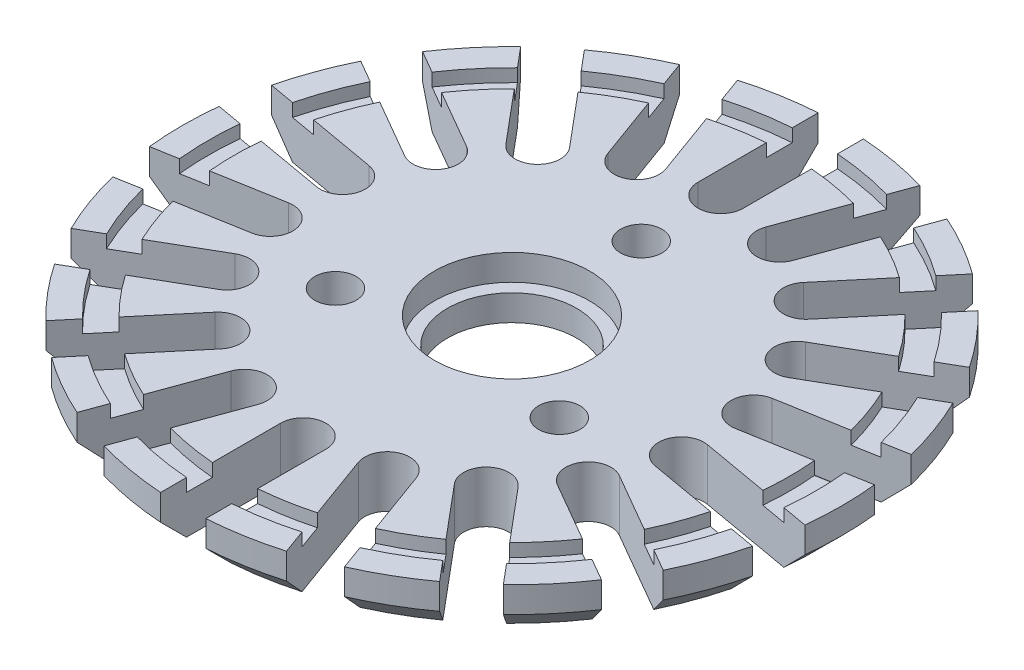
from build123d import *

# Parameters (mm, degrees)
ESBO_O1_R                = 5
RESSALTO_EXTRUS_O1_DEPTH = 4
ESBO_O2_R                = 6
CORTE_EXTRUS_O1_DEPTH    = 2
ESBO_O3_R                = 23.5
ESBO_O3_R_2              = 21.5
CORTE_EXTRUS_O2_DEPTH    = 1
CHANFRO1_SIZE            = 2
ESBO_O4_R                = 1.6
CORTE_EXTRUS_O3_DEPTH    = 37.241378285


with BuildPart() as part:
    # Esbo_o1 → Ressalto-extrus_o1 (new body)
    with BuildSketch(Plane(origin=(0, 0, 0), x_dir=(1, 0, 0), z_dir=(0, 1, 0))):
        with BuildLine():
            Line((1.75, 16.15), (1.75, 25.43988011))
            ThreePointArc((1.75, 25.43988011), (4.428028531, 25.112597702), (7.056489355, 24.504202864))
            Line((7.056489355, 24.504202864), (3.879163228, 15.774571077))
            ThreePointArc((3.879163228, 15.774571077), (4.925090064, 13.531573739), (7.168087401, 14.577500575))
            Line((7.168087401, 14.577500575), (10.345413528, 23.307132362))
            ThreePointArc((10.345413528, 23.307132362), (12.75, 22.083647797), (15.011861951, 20.612957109))
            Line((15.011861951, 20.612957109), (9.040442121, 13.496496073))
            ThreePointArc((9.040442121, 13.496496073), (9.256141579, 11.031039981), (11.721597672, 11.246739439))
            Line((11.721597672, 11.246739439), (17.693017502, 18.363200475))
            ThreePointArc((17.693017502, 18.363200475), (19.5341333, 16.391084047), (21.156582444, 14.235484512))
            Line((21.156582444, 14.235484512), (13.111310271, 9.590544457))
            ThreePointArc((13.111310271, 9.590544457), (12.470765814, 7.2), (14.861310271, 6.559455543))
            Line((14.861310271, 6.559455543), (22.906582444, 11.204395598))
            ThreePointArc((22.906582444, 11.204395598), (23.96216183, 8.721513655), (24.749506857, 6.141002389))
            Line((24.749506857, 6.141002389), (15.6007609, 4.527831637))
            ThreePointArc((15.6007609, 4.527831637), (14.181231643, 2.500533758), (16.208529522, 1.081004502))
            Line((16.208529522, 1.081004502), (25.357275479, 2.694175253))
            ThreePointArc((25.357275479, 2.694175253), (25.5, 0), (25.357275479, -2.694175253))
            Line((25.357275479, -2.694175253), (16.208529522, -1.081004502))
            ThreePointArc((16.208529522, -1.081004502), (14.181231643, -2.500533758), (15.6007609, -4.527831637))
            Line((15.6007609, -4.527831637), (24.749506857, -6.141002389))
            ThreePointArc((24.749506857, -6.141002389), (23.96216183, -8.721513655), (22.906582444, -11.204395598))
            Line((22.906582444, -11.204395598), (14.861310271, -6.559455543))
            ThreePointArc((14.861310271, -6.559455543), (12.470765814, -7.2), (13.111310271, -9.590544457))
            Line((13.111310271, -9.590544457), (21.156582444, -14.235484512))
            ThreePointArc((21.156582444, -14.235484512), (19.5341333, -16.391084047), (17.693017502, -18.363200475))
            Line((17.693017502, -18.363200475), (11.721597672, -11.246739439))
            ThreePointArc((11.721597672, -11.246739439), (9.256141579, -11.031039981), (9.040442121, -13.496496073))
            Line((9.040442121, -13.496496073), (15.011861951, -20.612957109))
            ThreePointArc((15.011861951, -20.612957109), (12.75, -22.083647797), (10.345413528, -23.307132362))
            Line((10.345413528, -23.307132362), (7.168087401, -14.577500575))
            ThreePointArc((7.168087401, -14.577500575), (4.925090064, -13.531573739), (3.879163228, -15.774571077))
            Line((3.879163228, -15.774571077), (7.056489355, -24.504202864))
            ThreePointArc((7.056489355, -24.504202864), (4.428028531, -25.112597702), (1.75, -25.43988011))
            Line((1.75, -25.43988011), (1.75, -16.15))
            ThreePointArc((1.75, -16.15), (0, -14.4), (-1.75, -16.15))
            Line((-1.75, -16.15), (-1.75, -25.43988011))
            ThreePointArc((-1.75, -25.43988011), (-4.428028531, -25.112597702), (-7.056489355, -24.504202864))
            Line((-7.056489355, -24.504202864), (-3.879163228, -15.774571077))
            ThreePointArc((-3.879163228, -15.774571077), (-4.925090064, -13.531573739), (-7.168087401, -14.577500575))
            Line((-7.168087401, -14.577500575), (-10.345413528, -23.307132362))
            ThreePointArc((-10.345413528, -23.307132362), (-12.75, -22.083647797), (-15.011861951, -20.612957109))
            Line((-15.011861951, -20.612957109), (-9.040442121, -13.496496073))
            ThreePointArc((-9.040442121, -13.496496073), (-9.256141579, -11.031039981), (-11.721597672, -11.246739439))
            Line((-11.721597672, -11.246739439), (-17.693017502, -18.363200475))
            ThreePointArc((-17.693017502, -18.363200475), (-19.5341333, -16.391084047), (-21.156582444, -14.235484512))
            Line((-21.156582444, -14.235484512), (-13.111310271, -9.590544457))
            ThreePointArc((-13.111310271, -9.590544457), (-12.470765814, -7.2), (-14.861310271, -6.559455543))
            Line((-14.861310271, -6.559455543), (-22.906582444, -11.204395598))
            ThreePointArc((-22.906582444, -11.204395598), (-23.96216183, -8.721513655), (-24.749506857, -6.141002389))
            Line((-24.749506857, -6.141002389), (-15.6007609, -4.527831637))
            ThreePointArc((-15.6007609, -4.527831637), (-14.181231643, -2.500533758), (-16.208529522, -1.081004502))
            Line((-16.208529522, -1.081004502), (-25.357275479, -2.694175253))
            ThreePointArc((-25.357275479, -2.694175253), (-25.5, 0), (-25.357275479, 2.694175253))
            Line((-25.357275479, 2.694175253), (-16.208529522, 1.081004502))
            ThreePointArc((-16.208529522, 1.081004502), (-14.181231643, 2.500533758), (-15.6007609, 4.527831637))
            Line((-15.6007609, 4.527831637), (-24.749506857, 6.141002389))
            ThreePointArc((-24.749506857, 6.141002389), (-23.96216183, 8.721513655), (-22.906582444, 11.204395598))
            Line((-22.906582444, 11.204395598), (-14.861310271, 6.559455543))
            ThreePointArc((-14.861310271, 6.559455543), (-12.470765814, 7.2), (-13.111310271, 9.590544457))
            Line((-13.111310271, 9.590544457), (-21.156582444, 14.235484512))
            ThreePointArc((-21.156582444, 14.235484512), (-19.5341333, 16.391084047), (-17.693017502, 18.363200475))
            Line((-17.693017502, 18.363200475), (-11.721597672, 11.246739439))
            ThreePointArc((-11.721597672, 11.246739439), (-9.256141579, 11.031039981), (-9.040442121, 13.496496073))
            Line((-9.040442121, 13.496496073), (-15.011861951, 20.612957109))
            ThreePointArc((-15.011861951, 20.612957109), (-12.75, 22.083647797), (-10.345413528, 23.307132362))
            Line((-10.345413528, 23.307132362), (-7.168087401, 14.577500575))
            ThreePointArc((-7.168087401, 14.577500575), (-4.925090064, 13.531573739), (-3.879163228, 15.774571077))
            Line((-3.879163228, 15.774571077), (-7.056489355, 24.504202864))
            ThreePointArc((-7.056489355, 24.504202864), (-4.428028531, 25.112597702), (-1.75, 25.43988011))
            Line((-1.75, 25.43988011), (-1.75, 16.15))
            ThreePointArc((-1.75, 16.15), (0, 14.4), (1.75, 16.15))
        make_face()
        with Locations(Location((0, 0, 0), (0, 0, 270))):
            Circle(ESBO_O1_R, mode=Mode.SUBTRACT)
    extrude(amount=RESSALTO_EXTRUS_O1_DEPTH)

    # Esbo_o2 → Corte-extrus_o1 (cut)
    with BuildSketch(Plane(origin=(0, 4, 0), x_dir=(1, 0, 0), z_dir=(0, 1, 0))):
        with Locations(Location((0, 0, 0), (0, 0, 270))):
            Circle(ESBO_O2_R)
    extrude(amount=-CORTE_EXTRUS_O1_DEPTH, mode=Mode.SUBTRACT)

    # Esbo_o3 → Corte-extrus_o2 (cut)
    with BuildSketch(Plane(origin=(0, 4, 0), x_dir=(1, 0, 0), z_dir=(0, 1, 0))):
        Circle(ESBO_O3_R)
        Circle(ESBO_O3_R_2, mode=Mode.SUBTRACT)
    extrude(amount=-CORTE_EXTRUS_O2_DEPTH, mode=Mode.SUBTRACT)

    # Chanfro1
    chanfro1_edges = [part.edges().sort_by_distance(p)[0] for p in [
        (4.428028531, 0, -25.112597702),
        (12.75, 0, -22.083647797),
        (19.5341333, 0, -16.391084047),
        (23.96216183, 0, -8.721513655),
        (25.5, 0, 0),
        (23.96216183, 0, 8.721513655),
        (19.5341333, 0, 16.391084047),
        (12.75, 0, 22.083647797),
        (4.428028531, 0, 25.112597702),
        (-4.428028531, 0, 25.112597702),
        (-12.75, 0, 22.083647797),
        (-19.5341333, 0, 16.391084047),
        (-23.96216183, 0, 8.721513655),
        (-25.5, 0, 0),
        (-23.96216183, 0, -8.721513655),
        (-19.5341333, 0, -16.391084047),
        (-12.75, 0, -22.083647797),
        (-4.428028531, 0, -25.112597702),
    ]]
    chamfer(chanfro1_edges, length=CHANFRO1_SIZE)

    # Esbo_o4 → Corte-extrus_o3 (cut, through all)
    with BuildSketch(Plane.XZ):
        with Locations(Location((0, -10, 0), (0, 0, 270))):
            Circle(ESBO_O4_R)
        with Locations(Location((-8.660254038, 5, 0), (0, 0, 270))):
            Circle(ESBO_O4_R)
        with Locations(Location((8.660254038, 5, 0), (0, 0, 270))):
            Circle(ESBO_O4_R)
    extrude(amount=-CORTE_EXTRUS_O3_DEPTH, mode=Mode.SUBTRACT)


solid = part.part
